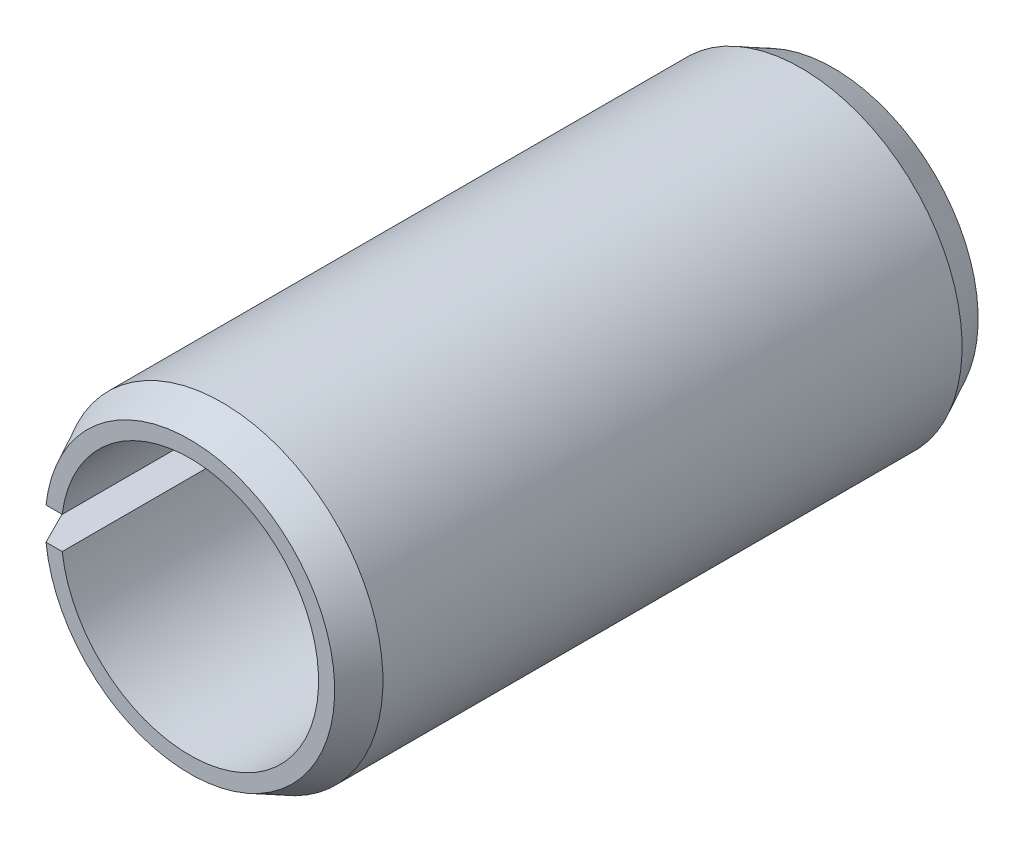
ISO-10303-21;
HEADER;
FILE_DESCRIPTION(('STEP AP214'),'2;1');
FILE_NAME('part.step','',(''),(''),'','','');
FILE_SCHEMA(('AUTOMOTIVE_DESIGN { 1 0 10303 214 1 1 1 1 }'));
ENDSEC;
DATA;
#1=APPLICATION_CONTEXT('core data for automotive mechanical design processes');
#2=APPLICATION_PROTOCOL_DEFINITION('international standard','automotive_design',2000,#1);
#3=PRODUCT_CONTEXT('',#1,'mechanical');
#4=PRODUCT('Part','Part','',(#3));
#5=PRODUCT_RELATED_PRODUCT_CATEGORY('part','',(#4));
#6=PRODUCT_DEFINITION_FORMATION('','',#4);
#7=PRODUCT_DEFINITION_CONTEXT('part definition',#1,'design');
#8=PRODUCT_DEFINITION('design','',#6,#7);
#9=PRODUCT_DEFINITION_SHAPE('','',#8);
#10=(LENGTH_UNIT() NAMED_UNIT(*) SI_UNIT(.MILLI.,.METRE.));
#11=(NAMED_UNIT(*) PLANE_ANGLE_UNIT() SI_UNIT($,.RADIAN.));
#12=(NAMED_UNIT(*) SI_UNIT($,.STERADIAN.) SOLID_ANGLE_UNIT());
#13=UNCERTAINTY_MEASURE_WITH_UNIT(LENGTH_MEASURE(1.E-05),#10,'distance_accuracy_value','');
#14=(GEOMETRIC_REPRESENTATION_CONTEXT(3) GLOBAL_UNCERTAINTY_ASSIGNED_CONTEXT((#13)) GLOBAL_UNIT_ASSIGNED_CONTEXT((#10,
#11,#12)) REPRESENTATION_CONTEXT('',''));
#15=CARTESIAN_POINT('',(0.,0.,0.));
#16=DIRECTION('',(0.,0.,1.));
#17=DIRECTION('',(1.,0.,0.));
#18=AXIS2_PLACEMENT_3D('',#15,#16,#17);
#19=CARTESIAN_POINT('',(0.,1.125,0.));
#20=DIRECTION('',(0.,0.,-1.));
#21=DIRECTION('',(-1.,0.,0.));
#22=AXIS2_PLACEMENT_3D('',#19,#20,#21);
#23=PLANE('',#22);
#24=CARTESIAN_POINT('',(0.,0.,-5.6843418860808E-11));
#25=DIRECTION('',(0.,0.,1.));
#26=DIRECTION('',(1.,0.,0.));
#27=AXIS2_PLACEMENT_3D('',#24,#25,#26);
#28=CIRCLE('',#27,2.24999999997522);
#29=CARTESIAN_POINT('',(-2.23606797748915,-0.25,-2.84216409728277E-11));
#30=VERTEX_POINT('',#29);
#31=CARTESIAN_POINT('',(-2.23606797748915,0.25,-2.84215725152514E-11));
#32=VERTEX_POINT('',#31);
#33=EDGE_CURVE('E72',#30,#32,#28,.T.);
#34=ORIENTED_EDGE('',*,*,#33,.F.);
#35=DIRECTION('',(1.,0.,0.));
#36=VECTOR('',#35,1.);
#37=CARTESIAN_POINT('',(0.,-0.25,0.));
#38=LINE('',#37,#36);
#39=CARTESIAN_POINT('',(-1.98431348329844,-0.25,0.));
#40=VERTEX_POINT('',#39);
#41=EDGE_CURVE('E68',#30,#40,#38,.T.);
#42=ORIENTED_EDGE('',*,*,#41,.T.);
#43=CARTESIAN_POINT('',(0.,0.,0.));
#44=DIRECTION('',(0.,0.,1.));
#45=DIRECTION('',(1.,0.,0.));
#46=AXIS2_PLACEMENT_3D('',#43,#44,#45);
#47=CIRCLE('',#46,2.);
#48=CARTESIAN_POINT('',(-1.98431348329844,0.25,0.));
#49=VERTEX_POINT('',#48);
#50=EDGE_CURVE('E21',#40,#49,#47,.T.);
#51=ORIENTED_EDGE('',*,*,#50,.T.);
#52=DIRECTION('',(-1.,0.,0.));
#53=VECTOR('',#52,1.);
#54=CARTESIAN_POINT('',(0.,0.25,0.));
#55=LINE('',#54,#53);
#56=EDGE_CURVE('E86',#49,#32,#55,.T.);
#57=ORIENTED_EDGE('',*,*,#56,.T.);
#58=EDGE_LOOP('',(#34,#42,#51,#57));
#59=FACE_BOUND('',#58,.T.);
#60=ADVANCED_FACE('F17',(#59),#23,.T.);
#61=CARTESIAN_POINT('',(0.,0.,5.));
#62=DIRECTION('',(0.,0.,1.));
#63=DIRECTION('',(1.,0.,0.));
#64=AXIS2_PLACEMENT_3D('',#61,#62,#63);
#65=CYLINDRICAL_SURFACE('',#64,2.);
#66=CARTESIAN_POINT('',(0.,0.,10.));
#67=DIRECTION('',(0.,0.,1.));
#68=DIRECTION('',(1.,0.,0.));
#69=AXIS2_PLACEMENT_3D('',#66,#67,#68);
#70=CIRCLE('',#69,2.);
#71=CARTESIAN_POINT('',(-1.98431348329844,0.25,10.));
#72=VERTEX_POINT('',#71);
#73=CARTESIAN_POINT('',(-1.98431348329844,-0.25,10.));
#74=VERTEX_POINT('',#73);
#75=EDGE_CURVE('E85',#72,#74,#70,.F.);
#76=ORIENTED_EDGE('',*,*,#75,.F.);
#77=DIRECTION('',(0.,0.,1.));
#78=VECTOR('',#77,1.);
#79=CARTESIAN_POINT('',(-1.98431348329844,0.25,0.));
#80=LINE('',#79,#78);
#81=EDGE_CURVE('E84',#72,#49,#80,.F.);
#82=ORIENTED_EDGE('',*,*,#81,.T.);
#83=ORIENTED_EDGE('',*,*,#50,.F.);
#84=DIRECTION('',(0.,0.,-1.));
#85=VECTOR('',#84,1.);
#86=CARTESIAN_POINT('',(-1.98431348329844,-0.25,0.));
#87=LINE('',#86,#85);
#88=EDGE_CURVE('E76',#40,#74,#87,.F.);
#89=ORIENTED_EDGE('',*,*,#88,.T.);
#90=EDGE_LOOP('',(#76,#82,#83,#89));
#91=FACE_BOUND('',#90,.T.);
#92=ADVANCED_FACE('F81',(#91),#65,.F.);
#93=CARTESIAN_POINT('',(0.,1.125,10.));
#94=DIRECTION('',(0.,0.,1.));
#95=DIRECTION('',(0.,-1.,0.));
#96=AXIS2_PLACEMENT_3D('',#93,#94,#95);
#97=PLANE('',#96);
#98=CARTESIAN_POINT('',(0.,0.,10.0000000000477));
#99=DIRECTION('',(0.,0.,-1.));
#100=DIRECTION('',(-1.,0.,0.));
#101=AXIS2_PLACEMENT_3D('',#98,#99,#100);
#102=CIRCLE('',#101,2.24999999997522);
#103=CARTESIAN_POINT('',(-2.23606797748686,0.25,10.0000000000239));
#104=VERTEX_POINT('',#103);
#105=CARTESIAN_POINT('',(-2.23606797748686,-0.25,10.0000000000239));
#106=VERTEX_POINT('',#105);
#107=EDGE_CURVE('E94',#104,#106,#102,.T.);
#108=ORIENTED_EDGE('',*,*,#107,.F.);
#109=DIRECTION('',(1.,0.,0.));
#110=VECTOR('',#109,1.);
#111=CARTESIAN_POINT('',(-3.,0.25,10.));
#112=LINE('',#111,#110);
#113=EDGE_CURVE('E137',#104,#72,#112,.T.);
#114=ORIENTED_EDGE('',*,*,#113,.T.);
#115=ORIENTED_EDGE('',*,*,#75,.T.);
#116=DIRECTION('',(1.,0.,0.));
#117=VECTOR('',#116,1.);
#118=CARTESIAN_POINT('',(0.,-0.25,10.));
#119=LINE('',#118,#117);
#120=EDGE_CURVE('E77',#74,#106,#119,.F.);
#121=ORIENTED_EDGE('',*,*,#120,.T.);
#122=EDGE_LOOP('',(#108,#114,#115,#121));
#123=FACE_BOUND('',#122,.T.);
#124=ADVANCED_FACE('F145',(#123),#97,.T.);
#125=CARTESIAN_POINT('',(0.,-0.25,0.));
#126=DIRECTION('',(0.,-1.,0.));
#127=DIRECTION('',(0.,0.,-1.));
#128=AXIS2_PLACEMENT_3D('',#125,#126,#127);
#129=PLANE('',#128);
#130=ORIENTED_EDGE('',*,*,#41,.F.);
#131=CARTESIAN_POINT('',(-2.48746859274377,-0.25,0.50000000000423));
#132=CARTESIAN_POINT('',(-2.44558826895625,-0.25,0.416656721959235));
#133=CARTESIAN_POINT('',(-2.40369805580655,-0.25,0.333318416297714));
#134=CARTESIAN_POINT('',(-2.31989785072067,-0.25,0.166651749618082));
#135=CARTESIAN_POINT('',(-2.27798785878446,-0.25,0.0833233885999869));
#136=CARTESIAN_POINT('',(-2.23606797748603,-0.25,-3.46195994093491E-11));
#137=B_SPLINE_CURVE_WITH_KNOTS('',3,(#131,#132,#133,#134,#135,#136),.UNSPECIFIED.,.F.,.F.,(4,2,
4),(0.,0.279822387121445,0.559644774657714),.UNSPECIFIED.);
#138=CARTESIAN_POINT('',(-2.48746859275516,-0.25,0.500000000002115));
#139=VERTEX_POINT('',#138);
#140=EDGE_CURVE('E89',#139,#30,#137,.T.);
#141=ORIENTED_EDGE('',*,*,#140,.F.);
#142=DIRECTION('',(0.,0.,1.));
#143=VECTOR('',#142,1.);
#144=CARTESIAN_POINT('',(-2.48746859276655,-0.25,5.));
#145=LINE('',#144,#143);
#146=CARTESIAN_POINT('',(-2.48746859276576,-0.25,9.49999999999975));
#147=VERTEX_POINT('',#146);
#148=EDGE_CURVE('E97',#147,#139,#145,.F.);
#149=ORIENTED_EDGE('',*,*,#148,.F.);
#150=CARTESIAN_POINT('',(-2.23606797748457,-0.25,10.0000000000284));
#151=CARTESIAN_POINT('',(-2.27798785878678,-0.25,9.91667661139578));
#152=CARTESIAN_POINT('',(-2.31989785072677,-0.25,9.83334825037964));
#153=CARTESIAN_POINT('',(-2.4036980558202,-0.25,9.66668158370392));
#154=CARTESIAN_POINT('',(-2.44558826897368,-0.25,9.58334327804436));
#155=CARTESIAN_POINT('',(-2.48746859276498,-0.25,9.50000000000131));
#156=B_SPLINE_CURVE_WITH_KNOTS('',3,(#150,#151,#152,#153,#154,#155),.UNSPECIFIED.,.F.,.F.,(4,2,
4),(0.,0.279822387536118,0.559644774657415),.UNSPECIFIED.);
#157=EDGE_CURVE('E103',#106,#147,#156,.T.);
#158=ORIENTED_EDGE('',*,*,#157,.F.);
#159=ORIENTED_EDGE('',*,*,#120,.F.);
#160=ORIENTED_EDGE('',*,*,#88,.F.);
#161=EDGE_LOOP('',(#130,#141,#149,#158,#159,#160));
#162=FACE_BOUND('',#161,.T.);
#163=ADVANCED_FACE('F87',(#162),#129,.F.);
#164=CARTESIAN_POINT('',(0.,0.,0.499999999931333));
#165=DIRECTION('',(0.,0.,1.));
#166=DIRECTION('',(1.,0.,0.));
#167=AXIS2_PLACEMENT_3D('',#164,#165,#166);
#168=CONICAL_SURFACE('',#167,2.49999999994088,0.463647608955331);
#169=CARTESIAN_POINT('',(-2.23606797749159,0.25,-2.35696877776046E-11));
#170=CARTESIAN_POINT('',(-2.27798785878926,0.25,0.0833233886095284));
#171=CARTESIAN_POINT('',(-2.31989785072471,0.25,0.166651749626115));
#172=CARTESIAN_POINT('',(-2.40369805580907,0.25,0.333318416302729));
#173=CARTESIAN_POINT('',(-2.44558826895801,0.25,0.416656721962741));
#174=CARTESIAN_POINT('',(-2.48746859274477,0.25,0.500000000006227));
#175=B_SPLINE_CURVE_WITH_KNOTS('',3,(#169,#170,#171,#172,#173,#174),.UNSPECIFIED.,.F.,.F.,(4,2,
4),(0.,0.279822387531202,0.55964477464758),.UNSPECIFIED.);
#176=CARTESIAN_POINT('',(-2.48746859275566,0.25,0.500000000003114));
#177=VERTEX_POINT('',#176);
#178=EDGE_CURVE('E139',#32,#177,#175,.T.);
#179=ORIENTED_EDGE('',*,*,#178,.T.);
#180=CARTESIAN_POINT('',(0.,0.,0.5));
#181=DIRECTION('',(0.,0.,1.));
#182=DIRECTION('',(1.,0.,0.));
#183=AXIS2_PLACEMENT_3D('',#180,#181,#182);
#184=CIRCLE('',#183,2.5);
#185=EDGE_CURVE('E130',#139,#177,#184,.T.);
#186=ORIENTED_EDGE('',*,*,#185,.F.);
#187=ORIENTED_EDGE('',*,*,#140,.T.);
#188=ORIENTED_EDGE('',*,*,#33,.T.);
#189=EDGE_LOOP('',(#179,#186,#187,#188));
#190=FACE_BOUND('',#189,.T.);
#191=ADVANCED_FACE('F123',(#190),#168,.T.);
#192=CARTESIAN_POINT('',(-3.,0.25,0.));
#193=DIRECTION('',(0.,1.,0.));
#194=DIRECTION('',(0.,0.,1.));
#195=AXIS2_PLACEMENT_3D('',#192,#193,#194);
#196=PLANE('',#195);
#197=ORIENTED_EDGE('',*,*,#113,.F.);
#198=CARTESIAN_POINT('',(-2.48746859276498,0.25,9.50000000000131));
#199=CARTESIAN_POINT('',(-2.44558826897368,0.25,9.58334327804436));
#200=CARTESIAN_POINT('',(-2.40369805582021,0.25,9.66668158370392));
#201=CARTESIAN_POINT('',(-2.31989785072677,0.25,9.83334825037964));
#202=CARTESIAN_POINT('',(-2.27798785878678,0.25,9.91667661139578));
#203=CARTESIAN_POINT('',(-2.23606797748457,0.25,10.0000000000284));
#204=B_SPLINE_CURVE_WITH_KNOTS('',3,(#198,#199,#200,#201,#202,#203),.UNSPECIFIED.,.F.,.F.,(4,2,
4),(0.,0.279822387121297,0.559644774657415),.UNSPECIFIED.);
#205=CARTESIAN_POINT('',(-2.48746859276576,0.25,9.50000000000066));
#206=VERTEX_POINT('',#205);
#207=EDGE_CURVE('E36',#206,#104,#204,.T.);
#208=ORIENTED_EDGE('',*,*,#207,.F.);
#209=DIRECTION('',(0.,0.,1.));
#210=VECTOR('',#209,1.);
#211=CARTESIAN_POINT('',(-2.48746859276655,0.25,5.));
#212=LINE('',#211,#210);
#213=EDGE_CURVE('E27',#177,#206,#212,.T.);
#214=ORIENTED_EDGE('',*,*,#213,.F.);
#215=ORIENTED_EDGE('',*,*,#178,.F.);
#216=ORIENTED_EDGE('',*,*,#56,.F.);
#217=ORIENTED_EDGE('',*,*,#81,.F.);
#218=EDGE_LOOP('',(#197,#208,#214,#215,#216,#217));
#219=FACE_BOUND('',#218,.T.);
#220=ADVANCED_FACE('F109',(#219),#196,.F.);
#221=CARTESIAN_POINT('',(0.,0.,9.50000000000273));
#222=DIRECTION('',(0.,0.,-1.));
#223=DIRECTION('',(-1.,0.,0.));
#224=AXIS2_PLACEMENT_3D('',#221,#222,#223);
#225=CONICAL_SURFACE('',#224,2.49999999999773,0.463647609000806);
#226=ORIENTED_EDGE('',*,*,#207,.T.);
#227=ORIENTED_EDGE('',*,*,#107,.T.);
#228=ORIENTED_EDGE('',*,*,#157,.T.);
#229=CARTESIAN_POINT('',(0.,0.,9.5));
#230=DIRECTION('',(0.,0.,1.));
#231=DIRECTION('',(1.,0.,0.));
#232=AXIS2_PLACEMENT_3D('',#229,#230,#231);
#233=CIRCLE('',#232,2.5);
#234=EDGE_CURVE('E11',#206,#147,#233,.F.);
#235=ORIENTED_EDGE('',*,*,#234,.F.);
#236=EDGE_LOOP('',(#226,#227,#228,#235));
#237=FACE_BOUND('',#236,.T.);
#238=ADVANCED_FACE('F112',(#237),#225,.T.);
#239=CARTESIAN_POINT('',(0.,0.,5.));
#240=DIRECTION('',(0.,0.,1.));
#241=DIRECTION('',(1.,0.,0.));
#242=AXIS2_PLACEMENT_3D('',#239,#240,#241);
#243=CYLINDRICAL_SURFACE('',#242,2.5);
#244=ORIENTED_EDGE('',*,*,#213,.T.);
#245=ORIENTED_EDGE('',*,*,#234,.T.);
#246=ORIENTED_EDGE('',*,*,#148,.T.);
#247=ORIENTED_EDGE('',*,*,#185,.T.);
#248=EDGE_LOOP('',(#244,#245,#246,#247));
#249=FACE_BOUND('',#248,.T.);
#250=ADVANCED_FACE('F19',(#249),#243,.T.);
#251=CLOSED_SHELL('',(#60,#92,#124,#163,#191,#220,#238,#250));
#252=MANIFOLD_SOLID_BREP('B1',#251);
#253=ADVANCED_BREP_SHAPE_REPRESENTATION('',(#18,#252),#14);
#254=SHAPE_DEFINITION_REPRESENTATION(#9,#253);
ENDSEC;
END-ISO-10303-21;
